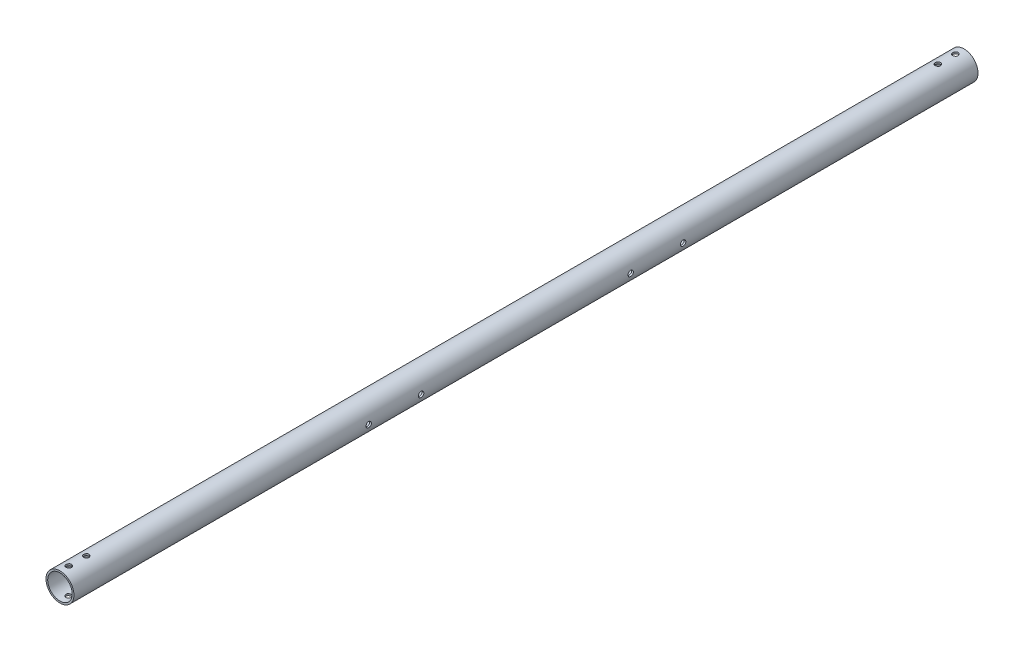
from build123d import *

# Parameters (mm, degrees)
SKETCH_1_R               = 8
SKETCH_1_R_2             = 7
EXTRUDE_1_DEPTH          = 517.5
CUT_EXTRUDE_1_DEPTH      = 518.623656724
CUT_EXTRUDE_1_DEPTH_BACK = 518.623656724
SKETCH_2_R               = 1.55
CUT_EXTRUDE_2_DEPTH      = 518.623656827
CUT_EXTRUDE_2_DEPTH_BACK = 518.623656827
SKETCH_3_R               = 1.55


with BuildPart() as part:
    # Sketch 1 → Extrude 1 (new body)
    with BuildSketch(Plane.XY):
        Circle(SKETCH_1_R)
        Circle(SKETCH_1_R_2, mode=Mode.SUBTRACT)
    extrude(amount=EXTRUDE_1_DEPTH)

    # Sketch 2 → Cut-Extrude 1 (cut, two sides: drawn at the far end of the back side and taken through both)
    with BuildSketch(Plane(origin=(0, 0, 0), x_dir=(1, 0, 0), z_dir=(0, 1, 0)).offset(-CUT_EXTRUDE_1_DEPTH_BACK)):
        with Locations(Location((0, -5, 0), (0, 0, 270))):
            Circle(SKETCH_2_R)
        with Locations(Location((0, -15, 0), (0, 0, 270))):
            Circle(SKETCH_2_R)
        with Locations(Location((0, -502.5, 0), (0, 0, 270))):
            Circle(SKETCH_2_R)
        with Locations(Location((0, -512.5, 0), (0, 0, 270))):
            Circle(SKETCH_2_R)
    extrude(amount=CUT_EXTRUDE_1_DEPTH + CUT_EXTRUDE_1_DEPTH_BACK, mode=Mode.SUBTRACT)

    # Sketch 3 → Cut-Extrude 2 (cut, two sides: drawn at the far end of the back side and taken through both)
    with BuildSketch(Plane(origin=(0, 0, 0), x_dir=(0, 0, -1), z_dir=(1, 0, 0)).offset(-CUT_EXTRUDE_2_DEPTH_BACK)):
        with Locations((-348.75, 0)):
            Circle(SKETCH_3_R)
        with Locations((-318.75, 0)):
            Circle(SKETCH_3_R)
        with Locations((-168.75, 0)):
            Circle(SKETCH_3_R)
        with Locations((-198.75, 0)):
            Circle(SKETCH_3_R)
    extrude(amount=CUT_EXTRUDE_2_DEPTH + CUT_EXTRUDE_2_DEPTH_BACK, mode=Mode.SUBTRACT)


solid = part.part
